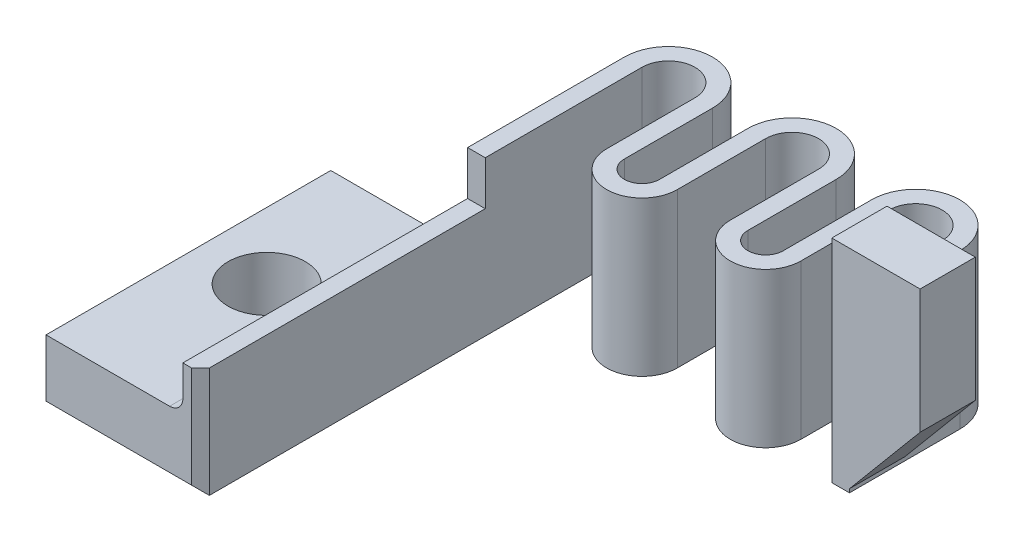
ISO-10303-21;
HEADER;
FILE_DESCRIPTION(('STEP AP214'),'2;1');
FILE_NAME('part.step','',(''),(''),'','','');
FILE_SCHEMA(('AUTOMOTIVE_DESIGN { 1 0 10303 214 1 1 1 1 }'));
ENDSEC;
DATA;
#1=APPLICATION_CONTEXT('core data for automotive mechanical design processes');
#2=APPLICATION_PROTOCOL_DEFINITION('international standard','automotive_design',2000,#1);
#3=PRODUCT_CONTEXT('',#1,'mechanical');
#4=PRODUCT('Part','Part','',(#3));
#5=PRODUCT_RELATED_PRODUCT_CATEGORY('part','',(#4));
#6=PRODUCT_DEFINITION_FORMATION('','',#4);
#7=PRODUCT_DEFINITION_CONTEXT('part definition',#1,'design');
#8=PRODUCT_DEFINITION('design','',#6,#7);
#9=PRODUCT_DEFINITION_SHAPE('','',#8);
#10=(LENGTH_UNIT() NAMED_UNIT(*) SI_UNIT(.MILLI.,.METRE.));
#11=(NAMED_UNIT(*) PLANE_ANGLE_UNIT() SI_UNIT($,.RADIAN.));
#12=(NAMED_UNIT(*) SI_UNIT($,.STERADIAN.) SOLID_ANGLE_UNIT());
#13=UNCERTAINTY_MEASURE_WITH_UNIT(LENGTH_MEASURE(1.E-05),#10,'distance_accuracy_value','');
#14=(GEOMETRIC_REPRESENTATION_CONTEXT(3) GLOBAL_UNCERTAINTY_ASSIGNED_CONTEXT((#13)) GLOBAL_UNIT_ASSIGNED_CONTEXT((#10,
#11,#12)) REPRESENTATION_CONTEXT('',''));
#15=CARTESIAN_POINT('',(0.,0.,0.));
#16=DIRECTION('',(0.,0.,1.));
#17=DIRECTION('',(1.,0.,0.));
#18=AXIS2_PLACEMENT_3D('',#15,#16,#17);
#19=CARTESIAN_POINT('',(0.,7.,0.));
#20=DIRECTION('',(1.,0.,0.));
#21=DIRECTION('',(0.,0.,-1.));
#22=AXIS2_PLACEMENT_3D('',#19,#20,#21);
#23=PLANE('',#22);
#24=DIRECTION('',(0.,-1.,0.));
#25=VECTOR('',#24,1.);
#26=CARTESIAN_POINT('',(0.,3.,-13.5));
#27=LINE('',#26,#25);
#28=CARTESIAN_POINT('',(0.,0.,-13.5));
#29=VERTEX_POINT('',#28);
#30=CARTESIAN_POINT('',(0.,3.6,-13.5));
#31=VERTEX_POINT('',#30);
#32=EDGE_CURVE('E65',#29,#31,#27,.F.);
#33=ORIENTED_EDGE('',*,*,#32,.T.);
#34=DIRECTION('',(0.,0.,-1.));
#35=VECTOR('',#34,1.);
#36=CARTESIAN_POINT('',(0.,3.6,0.));
#37=LINE('',#36,#35);
#38=CARTESIAN_POINT('',(0.,3.6,0.));
#39=VERTEX_POINT('',#38);
#40=EDGE_CURVE('E457',#31,#39,#37,.F.);
#41=ORIENTED_EDGE('',*,*,#40,.T.);
#42=DIRECTION('',(0.,-1.,0.));
#43=VECTOR('',#42,1.);
#44=CARTESIAN_POINT('',(0.,7.,0.));
#45=LINE('',#44,#43);
#46=CARTESIAN_POINT('',(0.,5.,0.));
#47=VERTEX_POINT('',#46);
#48=EDGE_CURVE('E300',#47,#39,#45,.T.);
#49=ORIENTED_EDGE('',*,*,#48,.F.);
#50=DIRECTION('',(0.,0.,1.));
#51=VECTOR('',#50,1.);
#52=CARTESIAN_POINT('',(0.,5.,0.));
#53=LINE('',#52,#51);
#54=CARTESIAN_POINT('',(0.,5.,-12.9));
#55=VERTEX_POINT('',#54);
#56=EDGE_CURVE('E289',#55,#47,#53,.T.);
#57=ORIENTED_EDGE('',*,*,#56,.F.);
#58=DIRECTION('',(0.,-1.,0.));
#59=VECTOR('',#58,1.);
#60=CARTESIAN_POINT('',(0.,7.,-12.9));
#61=LINE('',#60,#59);
#62=CARTESIAN_POINT('',(0.,7.,-12.9));
#63=VERTEX_POINT('',#62);
#64=EDGE_CURVE('E281',#63,#55,#61,.T.);
#65=ORIENTED_EDGE('',*,*,#64,.F.);
#66=DIRECTION('',(0.,0.,1.));
#67=VECTOR('',#66,1.);
#68=CARTESIAN_POINT('',(0.,7.,0.));
#69=LINE('',#68,#67);
#70=CARTESIAN_POINT('',(0.,7.,-20.));
#71=VERTEX_POINT('',#70);
#72=EDGE_CURVE('E293',#71,#63,#69,.T.);
#73=ORIENTED_EDGE('',*,*,#72,.F.);
#74=DIRECTION('',(0.,-1.,0.));
#75=VECTOR('',#74,1.);
#76=CARTESIAN_POINT('',(0.,7.,-20.));
#77=LINE('',#76,#75);
#78=CARTESIAN_POINT('',(0.,0.,-20.));
#79=VERTEX_POINT('',#78);
#80=EDGE_CURVE('E303',#71,#79,#77,.T.);
#81=ORIENTED_EDGE('',*,*,#80,.T.);
#82=DIRECTION('',(0.,0.,1.));
#83=VECTOR('',#82,1.);
#84=CARTESIAN_POINT('',(0.,0.,0.));
#85=LINE('',#84,#83);
#86=EDGE_CURVE('E356',#79,#29,#85,.T.);
#87=ORIENTED_EDGE('',*,*,#86,.T.);
#88=EDGE_LOOP('',(#33,#41,#49,#57,#65,#73,#81,#87));
#89=FACE_BOUND('',#88,.T.);
#90=ADVANCED_FACE('F41',(#89),#23,.F.);
#91=CARTESIAN_POINT('',(0.8,7.,0.));
#92=DIRECTION('',(0.,0.,-1.));
#93=DIRECTION('',(-1.,0.,0.));
#94=AXIS2_PLACEMENT_3D('',#91,#92,#93);
#95=PLANE('',#94);
#96=DIRECTION('',(0.,1.,0.));
#97=VECTOR('',#96,1.);
#98=CARTESIAN_POINT('',(0.400000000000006,7.,0.));
#99=LINE('',#98,#97);
#100=CARTESIAN_POINT('',(0.400000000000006,0.399999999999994,0.));
#101=VERTEX_POINT('',#100);
#102=CARTESIAN_POINT('',(0.400000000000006,5.,0.));
#103=VERTEX_POINT('',#102);
#104=EDGE_CURVE('E421',#101,#103,#99,.T.);
#105=ORIENTED_EDGE('',*,*,#104,.T.);
#106=DIRECTION('',(-1.,0.,0.));
#107=VECTOR('',#106,1.);
#108=CARTESIAN_POINT('',(13.8541181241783,5.,0.));
#109=LINE('',#108,#107);
#110=EDGE_CURVE('E1124',#103,#47,#109,.T.);
#111=ORIENTED_EDGE('',*,*,#110,.T.);
#112=ORIENTED_EDGE('',*,*,#48,.T.);
#113=CARTESIAN_POINT('',(-0.6,3.6,0.));
#114=DIRECTION('',(0.,0.,-1.));
#115=DIRECTION('',(-1.,0.,0.));
#116=AXIS2_PLACEMENT_3D('',#113,#114,#115);
#117=CIRCLE('',#116,0.6);
#118=CARTESIAN_POINT('',(-0.600000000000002,3.,0.));
#119=VERTEX_POINT('',#118);
#120=EDGE_CURVE('E50',#39,#119,#117,.T.);
#121=ORIENTED_EDGE('',*,*,#120,.T.);
#122=DIRECTION('',(1.,0.,0.));
#123=VECTOR('',#122,1.);
#124=CARTESIAN_POINT('',(-6.2,3.,0.));
#125=LINE('',#124,#123);
#126=CARTESIAN_POINT('',(-6.2,3.,0.));
#127=VERTEX_POINT('',#126);
#128=EDGE_CURVE('E312',#127,#119,#125,.T.);
#129=ORIENTED_EDGE('',*,*,#128,.F.);
#130=DIRECTION('',(0.,1.,0.));
#131=VECTOR('',#130,1.);
#132=CARTESIAN_POINT('',(-6.2,0.,0.));
#133=LINE('',#132,#131);
#134=CARTESIAN_POINT('',(-6.2,0.399999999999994,0.));
#135=VERTEX_POINT('',#134);
#136=EDGE_CURVE('E628',#135,#127,#133,.T.);
#137=ORIENTED_EDGE('',*,*,#136,.F.);
#138=DIRECTION('',(1.,0.,0.));
#139=VECTOR('',#138,1.);
#140=CARTESIAN_POINT('',(0.8,0.399999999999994,0.));
#141=LINE('',#140,#139);
#142=EDGE_CURVE('E424',#135,#101,#141,.T.);
#143=ORIENTED_EDGE('',*,*,#142,.T.);
#144=EDGE_LOOP('',(#105,#111,#112,#121,#129,#137,#143));
#145=FACE_BOUND('',#144,.T.);
#146=ADVANCED_FACE('F464',(#145),#95,.F.);
#147=CARTESIAN_POINT('',(0.8,7.,-20.));
#148=DIRECTION('',(-1.,0.,0.));
#149=DIRECTION('',(0.,0.,1.));
#150=AXIS2_PLACEMENT_3D('',#147,#148,#149);
#151=PLANE('',#150);
#152=DIRECTION('',(0.,1.,0.));
#153=VECTOR('',#152,1.);
#154=CARTESIAN_POINT('',(0.8,7.,-12.9));
#155=LINE('',#154,#153);
#156=CARTESIAN_POINT('',(0.8,5.,-12.9));
#157=VERTEX_POINT('',#156);
#158=CARTESIAN_POINT('',(0.8,7.,-12.9));
#159=VERTEX_POINT('',#158);
#160=EDGE_CURVE('E284',#157,#159,#155,.T.);
#161=ORIENTED_EDGE('',*,*,#160,.F.);
#162=DIRECTION('',(0.,0.,-1.));
#163=VECTOR('',#162,1.);
#164=CARTESIAN_POINT('',(0.8,5.,0.));
#165=LINE('',#164,#163);
#166=CARTESIAN_POINT('',(0.8,5.,-0.399999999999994));
#167=VERTEX_POINT('',#166);
#168=EDGE_CURVE('E1121',#167,#157,#165,.T.);
#169=ORIENTED_EDGE('',*,*,#168,.F.);
#170=DIRECTION('',(0.,-1.,0.));
#171=VECTOR('',#170,1.);
#172=CARTESIAN_POINT('',(0.8,7.,-0.399999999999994));
#173=LINE('',#172,#171);
#174=CARTESIAN_POINT('',(0.8,0.,-0.399999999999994));
#175=VERTEX_POINT('',#174);
#176=EDGE_CURVE('E431',#167,#175,#173,.T.);
#177=ORIENTED_EDGE('',*,*,#176,.T.);
#178=DIRECTION('',(0.,0.,-1.));
#179=VECTOR('',#178,1.);
#180=CARTESIAN_POINT('',(0.8,0.,-20.));
#181=LINE('',#180,#179);
#182=CARTESIAN_POINT('',(0.8,0.,-20.));
#183=VERTEX_POINT('',#182);
#184=EDGE_CURVE('E309',#175,#183,#181,.T.);
#185=ORIENTED_EDGE('',*,*,#184,.T.);
#186=DIRECTION('',(0.,-1.,0.));
#187=VECTOR('',#186,1.);
#188=CARTESIAN_POINT('',(0.8,7.,-20.));
#189=LINE('',#188,#187);
#190=CARTESIAN_POINT('',(0.8,7.,-20.));
#191=VERTEX_POINT('',#190);
#192=EDGE_CURVE('E418',#191,#183,#189,.T.);
#193=ORIENTED_EDGE('',*,*,#192,.F.);
#194=DIRECTION('',(0.,0.,-1.));
#195=VECTOR('',#194,1.);
#196=CARTESIAN_POINT('',(0.8,7.,-20.));
#197=LINE('',#196,#195);
#198=EDGE_CURVE('E357',#159,#191,#197,.T.);
#199=ORIENTED_EDGE('',*,*,#198,.F.);
#200=EDGE_LOOP('',(#161,#169,#177,#185,#193,#199));
#201=FACE_BOUND('',#200,.T.);
#202=ADVANCED_FACE('F614',(#201),#151,.F.);
#203=CARTESIAN_POINT('',(2.,7.,-20.));
#204=DIRECTION('',(0.,-1.,0.));
#205=DIRECTION('',(0.,0.,-1.));
#206=AXIS2_PLACEMENT_3D('',#203,#204,#205);
#207=CYLINDRICAL_SURFACE('',#206,1.2);
#208=CARTESIAN_POINT('',(2.,0.,-20.));
#209=DIRECTION('',(0.,-1.,0.));
#210=DIRECTION('',(0.,0.,-1.));
#211=AXIS2_PLACEMENT_3D('',#208,#209,#210);
#212=CIRCLE('',#211,1.2);
#213=CARTESIAN_POINT('',(3.2,0.,-20.));
#214=VERTEX_POINT('',#213);
#215=EDGE_CURVE('E311',#183,#214,#212,.T.);
#216=ORIENTED_EDGE('',*,*,#215,.T.);
#217=DIRECTION('',(0.,-1.,0.));
#218=VECTOR('',#217,1.);
#219=CARTESIAN_POINT('',(3.2,7.,-20.));
#220=LINE('',#219,#218);
#221=CARTESIAN_POINT('',(3.2,7.,-20.));
#222=VERTEX_POINT('',#221);
#223=EDGE_CURVE('E415',#222,#214,#220,.T.);
#224=ORIENTED_EDGE('',*,*,#223,.F.);
#225=CARTESIAN_POINT('',(2.,7.,-20.));
#226=DIRECTION('',(0.,-1.,0.));
#227=DIRECTION('',(0.,0.,-1.));
#228=AXIS2_PLACEMENT_3D('',#225,#226,#227);
#229=CIRCLE('',#228,1.2);
#230=EDGE_CURVE('E611',#191,#222,#229,.T.);
#231=ORIENTED_EDGE('',*,*,#230,.F.);
#232=ORIENTED_EDGE('',*,*,#192,.T.);
#233=EDGE_LOOP('',(#216,#224,#231,#232));
#234=FACE_BOUND('',#233,.T.);
#235=ADVANCED_FACE('F610',(#234),#207,.F.);
#236=CARTESIAN_POINT('',(3.2,7.,-20.));
#237=DIRECTION('',(1.,0.,0.));
#238=DIRECTION('',(0.,0.,-1.));
#239=AXIS2_PLACEMENT_3D('',#236,#237,#238);
#240=PLANE('',#239);
#241=DIRECTION('',(0.,0.,1.));
#242=VECTOR('',#241,1.);
#243=CARTESIAN_POINT('',(3.2,0.,-20.));
#244=LINE('',#243,#242);
#245=CARTESIAN_POINT('',(3.2,0.,-16.));
#246=VERTEX_POINT('',#245);
#247=EDGE_CURVE('E314',#214,#246,#244,.T.);
#248=ORIENTED_EDGE('',*,*,#247,.T.);
#249=DIRECTION('',(0.,-1.,0.));
#250=VECTOR('',#249,1.);
#251=CARTESIAN_POINT('',(3.2,7.,-16.));
#252=LINE('',#251,#250);
#253=CARTESIAN_POINT('',(3.2,7.,-16.));
#254=VERTEX_POINT('',#253);
#255=EDGE_CURVE('E412',#254,#246,#252,.T.);
#256=ORIENTED_EDGE('',*,*,#255,.F.);
#257=DIRECTION('',(0.,0.,1.));
#258=VECTOR('',#257,1.);
#259=CARTESIAN_POINT('',(3.2,7.,-20.));
#260=LINE('',#259,#258);
#261=EDGE_CURVE('E607',#222,#254,#260,.T.);
#262=ORIENTED_EDGE('',*,*,#261,.F.);
#263=ORIENTED_EDGE('',*,*,#223,.T.);
#264=EDGE_LOOP('',(#248,#256,#262,#263));
#265=FACE_BOUND('',#264,.T.);
#266=ADVANCED_FACE('F604',(#265),#240,.F.);
#267=CARTESIAN_POINT('',(4.8,7.,-16.));
#268=DIRECTION('',(0.,-1.,0.));
#269=DIRECTION('',(0.,0.,-1.));
#270=AXIS2_PLACEMENT_3D('',#267,#268,#269);
#271=CYLINDRICAL_SURFACE('',#270,1.6);
#272=CARTESIAN_POINT('',(4.8,0.,-16.));
#273=DIRECTION('',(0.,1.,0.));
#274=DIRECTION('',(0.,0.,1.));
#275=AXIS2_PLACEMENT_3D('',#272,#273,#274);
#276=CIRCLE('',#275,1.6);
#277=CARTESIAN_POINT('',(6.4,0.,-16.));
#278=VERTEX_POINT('',#277);
#279=EDGE_CURVE('E316',#246,#278,#276,.T.);
#280=ORIENTED_EDGE('',*,*,#279,.T.);
#281=DIRECTION('',(0.,-1.,0.));
#282=VECTOR('',#281,1.);
#283=CARTESIAN_POINT('',(6.4,7.,-16.));
#284=LINE('',#283,#282);
#285=CARTESIAN_POINT('',(6.4,7.,-16.));
#286=VERTEX_POINT('',#285);
#287=EDGE_CURVE('E409',#286,#278,#284,.T.);
#288=ORIENTED_EDGE('',*,*,#287,.F.);
#289=CARTESIAN_POINT('',(4.8,7.,-16.));
#290=DIRECTION('',(0.,1.,0.));
#291=DIRECTION('',(0.,0.,1.));
#292=AXIS2_PLACEMENT_3D('',#289,#290,#291);
#293=CIRCLE('',#292,1.6);
#294=EDGE_CURVE('E599',#254,#286,#293,.T.);
#295=ORIENTED_EDGE('',*,*,#294,.F.);
#296=ORIENTED_EDGE('',*,*,#255,.T.);
#297=EDGE_LOOP('',(#280,#288,#295,#296));
#298=FACE_BOUND('',#297,.T.);
#299=ADVANCED_FACE('F598',(#298),#271,.T.);
#300=CARTESIAN_POINT('',(6.4,7.,-16.));
#301=DIRECTION('',(-1.,0.,0.));
#302=DIRECTION('',(0.,0.,1.));
#303=AXIS2_PLACEMENT_3D('',#300,#301,#302);
#304=PLANE('',#303);
#305=DIRECTION('',(0.,0.,-1.));
#306=VECTOR('',#305,1.);
#307=CARTESIAN_POINT('',(6.4,0.,-16.));
#308=LINE('',#307,#306);
#309=CARTESIAN_POINT('',(6.4,0.,-20.));
#310=VERTEX_POINT('',#309);
#311=EDGE_CURVE('E318',#278,#310,#308,.T.);
#312=ORIENTED_EDGE('',*,*,#311,.T.);
#313=DIRECTION('',(0.,-1.,0.));
#314=VECTOR('',#313,1.);
#315=CARTESIAN_POINT('',(6.4,7.,-20.));
#316=LINE('',#315,#314);
#317=CARTESIAN_POINT('',(6.4,7.,-20.));
#318=VERTEX_POINT('',#317);
#319=EDGE_CURVE('E406',#318,#310,#316,.T.);
#320=ORIENTED_EDGE('',*,*,#319,.F.);
#321=DIRECTION('',(0.,0.,-1.));
#322=VECTOR('',#321,1.);
#323=CARTESIAN_POINT('',(6.4,7.,-16.));
#324=LINE('',#323,#322);
#325=EDGE_CURVE('E594',#286,#318,#324,.T.);
#326=ORIENTED_EDGE('',*,*,#325,.F.);
#327=ORIENTED_EDGE('',*,*,#287,.T.);
#328=EDGE_LOOP('',(#312,#320,#326,#327));
#329=FACE_BOUND('',#328,.T.);
#330=ADVANCED_FACE('F593',(#329),#304,.F.);
#331=CARTESIAN_POINT('',(7.6,7.,-20.));
#332=DIRECTION('',(0.,-1.,0.));
#333=DIRECTION('',(0.,0.,-1.));
#334=AXIS2_PLACEMENT_3D('',#331,#332,#333);
#335=CYLINDRICAL_SURFACE('',#334,1.2);
#336=CARTESIAN_POINT('',(7.6,0.,-20.));
#337=DIRECTION('',(0.,-1.,0.));
#338=DIRECTION('',(0.,0.,-1.));
#339=AXIS2_PLACEMENT_3D('',#336,#337,#338);
#340=CIRCLE('',#339,1.2);
#341=CARTESIAN_POINT('',(8.8,0.,-20.));
#342=VERTEX_POINT('',#341);
#343=EDGE_CURVE('E320',#310,#342,#340,.T.);
#344=ORIENTED_EDGE('',*,*,#343,.T.);
#345=DIRECTION('',(0.,-1.,0.));
#346=VECTOR('',#345,1.);
#347=CARTESIAN_POINT('',(8.8,7.,-20.));
#348=LINE('',#347,#346);
#349=CARTESIAN_POINT('',(8.8,7.,-20.));
#350=VERTEX_POINT('',#349);
#351=EDGE_CURVE('E403',#350,#342,#348,.T.);
#352=ORIENTED_EDGE('',*,*,#351,.F.);
#353=CARTESIAN_POINT('',(7.6,7.,-20.));
#354=DIRECTION('',(0.,-1.,0.));
#355=DIRECTION('',(0.,0.,-1.));
#356=AXIS2_PLACEMENT_3D('',#353,#354,#355);
#357=CIRCLE('',#356,1.2);
#358=EDGE_CURVE('E590',#318,#350,#357,.T.);
#359=ORIENTED_EDGE('',*,*,#358,.F.);
#360=ORIENTED_EDGE('',*,*,#319,.T.);
#361=EDGE_LOOP('',(#344,#352,#359,#360));
#362=FACE_BOUND('',#361,.T.);
#363=ADVANCED_FACE('F587',(#362),#335,.F.);
#364=CARTESIAN_POINT('',(8.8,7.,-20.));
#365=DIRECTION('',(1.,0.,0.));
#366=DIRECTION('',(0.,0.,-1.));
#367=AXIS2_PLACEMENT_3D('',#364,#365,#366);
#368=PLANE('',#367);
#369=DIRECTION('',(0.,0.,1.));
#370=VECTOR('',#369,1.);
#371=CARTESIAN_POINT('',(8.8,0.,-20.));
#372=LINE('',#371,#370);
#373=CARTESIAN_POINT('',(8.8,0.,-16.));
#374=VERTEX_POINT('',#373);
#375=EDGE_CURVE('E322',#342,#374,#372,.T.);
#376=ORIENTED_EDGE('',*,*,#375,.T.);
#377=DIRECTION('',(0.,-1.,0.));
#378=VECTOR('',#377,1.);
#379=CARTESIAN_POINT('',(8.8,7.,-16.));
#380=LINE('',#379,#378);
#381=CARTESIAN_POINT('',(8.8,7.,-16.));
#382=VERTEX_POINT('',#381);
#383=EDGE_CURVE('E400',#382,#374,#380,.T.);
#384=ORIENTED_EDGE('',*,*,#383,.F.);
#385=DIRECTION('',(0.,0.,1.));
#386=VECTOR('',#385,1.);
#387=CARTESIAN_POINT('',(8.8,7.,-20.));
#388=LINE('',#387,#386);
#389=EDGE_CURVE('E581',#350,#382,#388,.T.);
#390=ORIENTED_EDGE('',*,*,#389,.F.);
#391=ORIENTED_EDGE('',*,*,#351,.T.);
#392=EDGE_LOOP('',(#376,#384,#390,#391));
#393=FACE_BOUND('',#392,.T.);
#394=ADVANCED_FACE('F580',(#393),#368,.F.);
#395=CARTESIAN_POINT('',(10.4,7.,-16.));
#396=DIRECTION('',(0.,-1.,0.));
#397=DIRECTION('',(0.,0.,-1.));
#398=AXIS2_PLACEMENT_3D('',#395,#396,#397);
#399=CYLINDRICAL_SURFACE('',#398,1.6);
#400=CARTESIAN_POINT('',(10.4,0.,-16.));
#401=DIRECTION('',(0.,1.,0.));
#402=DIRECTION('',(0.,0.,1.));
#403=AXIS2_PLACEMENT_3D('',#400,#401,#402);
#404=CIRCLE('',#403,1.6);
#405=CARTESIAN_POINT('',(12.,0.,-16.));
#406=VERTEX_POINT('',#405);
#407=EDGE_CURVE('E324',#374,#406,#404,.T.);
#408=ORIENTED_EDGE('',*,*,#407,.T.);
#409=DIRECTION('',(0.,-1.,0.));
#410=VECTOR('',#409,1.);
#411=CARTESIAN_POINT('',(12.,7.,-16.));
#412=LINE('',#411,#410);
#413=CARTESIAN_POINT('',(12.,7.,-16.));
#414=VERTEX_POINT('',#413);
#415=EDGE_CURVE('E397',#414,#406,#412,.T.);
#416=ORIENTED_EDGE('',*,*,#415,.F.);
#417=CARTESIAN_POINT('',(10.4,7.,-16.));
#418=DIRECTION('',(0.,1.,0.));
#419=DIRECTION('',(0.,0.,1.));
#420=AXIS2_PLACEMENT_3D('',#417,#418,#419);
#421=CIRCLE('',#420,1.6);
#422=EDGE_CURVE('E576',#382,#414,#421,.T.);
#423=ORIENTED_EDGE('',*,*,#422,.F.);
#424=ORIENTED_EDGE('',*,*,#383,.T.);
#425=EDGE_LOOP('',(#408,#416,#423,#424));
#426=FACE_BOUND('',#425,.T.);
#427=ADVANCED_FACE('F575',(#426),#399,.T.);
#428=CARTESIAN_POINT('',(12.,7.,-20.));
#429=DIRECTION('',(-1.,0.,0.));
#430=DIRECTION('',(0.,0.,1.));
#431=AXIS2_PLACEMENT_3D('',#428,#429,#430);
#432=PLANE('',#431);
#433=DIRECTION('',(0.,0.,-1.));
#434=VECTOR('',#433,1.);
#435=CARTESIAN_POINT('',(12.,0.,-20.));
#436=LINE('',#435,#434);
#437=CARTESIAN_POINT('',(12.,0.,-20.));
#438=VERTEX_POINT('',#437);
#439=EDGE_CURVE('E326',#406,#438,#436,.T.);
#440=ORIENTED_EDGE('',*,*,#439,.T.);
#441=DIRECTION('',(0.,-1.,0.));
#442=VECTOR('',#441,1.);
#443=CARTESIAN_POINT('',(12.,7.,-20.));
#444=LINE('',#443,#442);
#445=CARTESIAN_POINT('',(12.,7.,-20.));
#446=VERTEX_POINT('',#445);
#447=EDGE_CURVE('E394',#446,#438,#444,.T.);
#448=ORIENTED_EDGE('',*,*,#447,.F.);
#449=DIRECTION('',(0.,0.,-1.));
#450=VECTOR('',#449,1.);
#451=CARTESIAN_POINT('',(12.,7.,-20.));
#452=LINE('',#451,#450);
#453=EDGE_CURVE('E572',#414,#446,#452,.T.);
#454=ORIENTED_EDGE('',*,*,#453,.F.);
#455=ORIENTED_EDGE('',*,*,#415,.T.);
#456=EDGE_LOOP('',(#440,#448,#454,#455));
#457=FACE_BOUND('',#456,.T.);
#458=ADVANCED_FACE('F569',(#457),#432,.F.);
#459=CARTESIAN_POINT('',(13.2,7.,-20.));
#460=DIRECTION('',(0.,-1.,0.));
#461=DIRECTION('',(0.,0.,-1.));
#462=AXIS2_PLACEMENT_3D('',#459,#460,#461);
#463=CYLINDRICAL_SURFACE('',#462,1.2);
#464=CARTESIAN_POINT('',(13.2,0.,-20.));
#465=DIRECTION('',(0.,-1.,0.));
#466=DIRECTION('',(0.,0.,-1.));
#467=AXIS2_PLACEMENT_3D('',#464,#465,#466);
#468=CIRCLE('',#467,1.2);
#469=CARTESIAN_POINT('',(14.4,0.,-20.));
#470=VERTEX_POINT('',#469);
#471=EDGE_CURVE('E328',#438,#470,#468,.T.);
#472=ORIENTED_EDGE('',*,*,#471,.T.);
#473=DIRECTION('',(0.,-1.,0.));
#474=VECTOR('',#473,1.);
#475=CARTESIAN_POINT('',(14.4,7.,-20.));
#476=LINE('',#475,#474);
#477=CARTESIAN_POINT('',(14.4,7.,-20.));
#478=VERTEX_POINT('',#477);
#479=EDGE_CURVE('E391',#478,#470,#476,.T.);
#480=ORIENTED_EDGE('',*,*,#479,.F.);
#481=CARTESIAN_POINT('',(13.2,7.,-20.));
#482=DIRECTION('',(0.,-1.,0.));
#483=DIRECTION('',(0.,0.,-1.));
#484=AXIS2_PLACEMENT_3D('',#481,#482,#483);
#485=CIRCLE('',#484,1.2);
#486=EDGE_CURVE('E563',#446,#478,#485,.T.);
#487=ORIENTED_EDGE('',*,*,#486,.F.);
#488=ORIENTED_EDGE('',*,*,#447,.T.);
#489=EDGE_LOOP('',(#472,#480,#487,#488));
#490=FACE_BOUND('',#489,.T.);
#491=ADVANCED_FACE('F562',(#490),#463,.F.);
#492=CARTESIAN_POINT('',(14.4,7.,-15.));
#493=DIRECTION('',(1.,0.,0.));
#494=DIRECTION('',(0.,0.,-1.));
#495=AXIS2_PLACEMENT_3D('',#492,#493,#494);
#496=PLANE('',#495);
#497=DIRECTION('',(0.,1.,0.));
#498=VECTOR('',#497,1.);
#499=CARTESIAN_POINT('',(14.4,6.6,-17.5));
#500=LINE('',#499,#498);
#501=CARTESIAN_POINT('',(14.4,7.,-17.5));
#502=VERTEX_POINT('',#501);
#503=CARTESIAN_POINT('',(14.4,9.6,-17.5));
#504=VERTEX_POINT('',#503);
#505=EDGE_CURVE('E665',#502,#504,#500,.T.);
#506=ORIENTED_EDGE('',*,*,#505,.F.);
#507=DIRECTION('',(0.,0.,1.));
#508=VECTOR('',#507,1.);
#509=CARTESIAN_POINT('',(14.4,7.,-15.));
#510=LINE('',#509,#508);
#511=EDGE_CURVE('E559',#478,#502,#510,.T.);
#512=ORIENTED_EDGE('',*,*,#511,.F.);
#513=ORIENTED_EDGE('',*,*,#479,.T.);
#514=DIRECTION('',(0.,0.,1.));
#515=VECTOR('',#514,1.);
#516=CARTESIAN_POINT('',(14.4,0.,-15.));
#517=LINE('',#516,#515);
#518=CARTESIAN_POINT('',(14.4,0.,-15.));
#519=VERTEX_POINT('',#518);
#520=EDGE_CURVE('E330',#470,#519,#517,.T.);
#521=ORIENTED_EDGE('',*,*,#520,.T.);
#522=DIRECTION('',(0.,-1.,0.));
#523=VECTOR('',#522,1.);
#524=CARTESIAN_POINT('',(14.4,7.,-15.));
#525=LINE('',#524,#523);
#526=CARTESIAN_POINT('',(14.4,9.6,-15.));
#527=VERTEX_POINT('',#526);
#528=EDGE_CURVE('E389',#527,#519,#525,.T.);
#529=ORIENTED_EDGE('',*,*,#528,.F.);
#530=DIRECTION('',(0.,0.,1.));
#531=VECTOR('',#530,1.);
#532=CARTESIAN_POINT('',(14.4,9.6,-15.));
#533=LINE('',#532,#531);
#534=EDGE_CURVE('E667',#504,#527,#533,.T.);
#535=ORIENTED_EDGE('',*,*,#534,.F.);
#536=EDGE_LOOP('',(#506,#512,#513,#521,#529,#535));
#537=FACE_BOUND('',#536,.T.);
#538=ADVANCED_FACE('F556',(#537),#496,.F.);
#539=CARTESIAN_POINT('',(14.4,7.,-15.));
#540=DIRECTION('',(0.,0.,-1.));
#541=DIRECTION('',(-1.,0.,0.));
#542=AXIS2_PLACEMENT_3D('',#539,#540,#541);
#543=PLANE('',#542);
#544=DIRECTION('',(0.,-1.,0.));
#545=VECTOR('',#544,1.);
#546=CARTESIAN_POINT('',(15.2,7.,-15.));
#547=LINE('',#546,#545);
#548=CARTESIAN_POINT('',(15.2,0.164530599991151,-15.));
#549=VERTEX_POINT('',#548);
#550=CARTESIAN_POINT('',(15.2,0.,-15.));
#551=VERTEX_POINT('',#550);
#552=EDGE_CURVE('E387',#549,#551,#547,.T.);
#553=ORIENTED_EDGE('',*,*,#552,.F.);
#554=DIRECTION('',(0.642787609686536,0.766044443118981,0.));
#555=VECTOR('',#554,1.);
#556=CARTESIAN_POINT('',(18.23527090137,3.78182560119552,-15.));
#557=LINE('',#556,#555);
#558=CARTESIAN_POINT('',(18.4,3.97814209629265,-15.));
#559=VERTEX_POINT('',#558);
#560=EDGE_CURVE('E442',#549,#559,#557,.T.);
#561=ORIENTED_EDGE('',*,*,#560,.T.);
#562=DIRECTION('',(0.,1.,0.));
#563=VECTOR('',#562,1.);
#564=CARTESIAN_POINT('',(18.4,6.6,-15.));
#565=LINE('',#564,#563);
#566=CARTESIAN_POINT('',(18.4,9.6,-15.));
#567=VERTEX_POINT('',#566);
#568=EDGE_CURVE('E671',#559,#567,#565,.T.);
#569=ORIENTED_EDGE('',*,*,#568,.T.);
#570=DIRECTION('',(1.,0.,0.));
#571=VECTOR('',#570,1.);
#572=CARTESIAN_POINT('',(14.4,9.6,-15.));
#573=LINE('',#572,#571);
#574=EDGE_CURVE('E551',#527,#567,#573,.T.);
#575=ORIENTED_EDGE('',*,*,#574,.F.);
#576=ORIENTED_EDGE('',*,*,#528,.T.);
#577=DIRECTION('',(1.,0.,0.));
#578=VECTOR('',#577,1.);
#579=CARTESIAN_POINT('',(14.4,0.,-15.));
#580=LINE('',#579,#578);
#581=EDGE_CURVE('E333',#519,#551,#580,.T.);
#582=ORIENTED_EDGE('',*,*,#581,.T.);
#583=EDGE_LOOP('',(#553,#561,#569,#575,#576,#582));
#584=FACE_BOUND('',#583,.T.);
#585=ADVANCED_FACE('F548',(#584),#543,.F.);
#586=CARTESIAN_POINT('',(15.2,7.,-15.));
#587=DIRECTION('',(-1.,0.,0.));
#588=DIRECTION('',(0.,0.,1.));
#589=AXIS2_PLACEMENT_3D('',#586,#587,#588);
#590=PLANE('',#589);
#591=DIRECTION('',(0.,-1.,0.));
#592=VECTOR('',#591,1.);
#593=CARTESIAN_POINT('',(15.2,7.,-17.5));
#594=LINE('',#593,#592);
#595=CARTESIAN_POINT('',(15.2,7.,-17.5));
#596=VERTEX_POINT('',#595);
#597=CARTESIAN_POINT('',(15.2,0.164530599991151,-17.5));
#598=VERTEX_POINT('',#597);
#599=EDGE_CURVE('E437',#596,#598,#594,.T.);
#600=ORIENTED_EDGE('',*,*,#599,.T.);
#601=DIRECTION('',(0.,0.,1.));
#602=VECTOR('',#601,1.);
#603=CARTESIAN_POINT('',(15.2,0.164530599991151,-15.));
#604=LINE('',#603,#602);
#605=EDGE_CURVE('E439',#598,#549,#604,.T.);
#606=ORIENTED_EDGE('',*,*,#605,.T.);
#607=ORIENTED_EDGE('',*,*,#552,.T.);
#608=DIRECTION('',(0.,0.,-1.));
#609=VECTOR('',#608,1.);
#610=CARTESIAN_POINT('',(15.2,0.,-15.));
#611=LINE('',#610,#609);
#612=CARTESIAN_POINT('',(15.2,0.,-20.));
#613=VERTEX_POINT('',#612);
#614=EDGE_CURVE('E336',#551,#613,#611,.T.);
#615=ORIENTED_EDGE('',*,*,#614,.T.);
#616=DIRECTION('',(0.,-1.,0.));
#617=VECTOR('',#616,1.);
#618=CARTESIAN_POINT('',(15.2,7.,-20.));
#619=LINE('',#618,#617);
#620=CARTESIAN_POINT('',(15.2,7.,-20.));
#621=VERTEX_POINT('',#620);
#622=EDGE_CURVE('E384',#621,#613,#619,.T.);
#623=ORIENTED_EDGE('',*,*,#622,.F.);
#624=DIRECTION('',(0.,0.,-1.));
#625=VECTOR('',#624,1.);
#626=CARTESIAN_POINT('',(15.2,7.,-15.));
#627=LINE('',#626,#625);
#628=EDGE_CURVE('E541',#596,#621,#627,.T.);
#629=ORIENTED_EDGE('',*,*,#628,.F.);
#630=EDGE_LOOP('',(#600,#606,#607,#615,#623,#629));
#631=FACE_BOUND('',#630,.T.);
#632=ADVANCED_FACE('F540',(#631),#590,.F.);
#633=CARTESIAN_POINT('',(13.2,7.,-20.));
#634=DIRECTION('',(0.,-1.,0.));
#635=DIRECTION('',(0.,0.,-1.));
#636=AXIS2_PLACEMENT_3D('',#633,#634,#635);
#637=CYLINDRICAL_SURFACE('',#636,2.);
#638=CARTESIAN_POINT('',(13.2,0.,-20.));
#639=DIRECTION('',(0.,1.,0.));
#640=DIRECTION('',(0.,0.,-1.));
#641=AXIS2_PLACEMENT_3D('',#638,#639,#640);
#642=CIRCLE('',#641,2.);
#643=CARTESIAN_POINT('',(11.2,0.,-20.));
#644=VERTEX_POINT('',#643);
#645=EDGE_CURVE('E338',#613,#644,#642,.T.);
#646=ORIENTED_EDGE('',*,*,#645,.T.);
#647=DIRECTION('',(0.,-1.,0.));
#648=VECTOR('',#647,1.);
#649=CARTESIAN_POINT('',(11.2,7.,-20.));
#650=LINE('',#649,#648);
#651=CARTESIAN_POINT('',(11.2,7.,-20.));
#652=VERTEX_POINT('',#651);
#653=EDGE_CURVE('E381',#652,#644,#650,.T.);
#654=ORIENTED_EDGE('',*,*,#653,.F.);
#655=CARTESIAN_POINT('',(13.2,7.,-20.));
#656=DIRECTION('',(0.,1.,0.));
#657=DIRECTION('',(0.,0.,-1.));
#658=AXIS2_PLACEMENT_3D('',#655,#656,#657);
#659=CIRCLE('',#658,2.);
#660=EDGE_CURVE('E536',#621,#652,#659,.T.);
#661=ORIENTED_EDGE('',*,*,#660,.F.);
#662=ORIENTED_EDGE('',*,*,#622,.T.);
#663=EDGE_LOOP('',(#646,#654,#661,#662));
#664=FACE_BOUND('',#663,.T.);
#665=ADVANCED_FACE('F535',(#664),#637,.T.);
#666=CARTESIAN_POINT('',(11.2,7.,-20.));
#667=DIRECTION('',(1.,0.,0.));
#668=DIRECTION('',(0.,0.,-1.));
#669=AXIS2_PLACEMENT_3D('',#666,#667,#668);
#670=PLANE('',#669);
#671=DIRECTION('',(0.,0.,1.));
#672=VECTOR('',#671,1.);
#673=CARTESIAN_POINT('',(11.2,0.,-20.));
#674=LINE('',#673,#672);
#675=CARTESIAN_POINT('',(11.2,0.,-16.));
#676=VERTEX_POINT('',#675);
#677=EDGE_CURVE('E340',#644,#676,#674,.T.);
#678=ORIENTED_EDGE('',*,*,#677,.T.);
#679=DIRECTION('',(0.,-1.,0.));
#680=VECTOR('',#679,1.);
#681=CARTESIAN_POINT('',(11.2,7.,-16.));
#682=LINE('',#681,#680);
#683=CARTESIAN_POINT('',(11.2,7.,-16.));
#684=VERTEX_POINT('',#683);
#685=EDGE_CURVE('E378',#684,#676,#682,.T.);
#686=ORIENTED_EDGE('',*,*,#685,.F.);
#687=DIRECTION('',(0.,0.,1.));
#688=VECTOR('',#687,1.);
#689=CARTESIAN_POINT('',(11.2,7.,-20.));
#690=LINE('',#689,#688);
#691=EDGE_CURVE('E532',#652,#684,#690,.T.);
#692=ORIENTED_EDGE('',*,*,#691,.F.);
#693=ORIENTED_EDGE('',*,*,#653,.T.);
#694=EDGE_LOOP('',(#678,#686,#692,#693));
#695=FACE_BOUND('',#694,.T.);
#696=ADVANCED_FACE('F529',(#695),#670,.F.);
#697=CARTESIAN_POINT('',(10.4,7.,-16.));
#698=DIRECTION('',(0.,-1.,0.));
#699=DIRECTION('',(0.,0.,-1.));
#700=AXIS2_PLACEMENT_3D('',#697,#698,#699);
#701=CYLINDRICAL_SURFACE('',#700,0.8);
#702=CARTESIAN_POINT('',(10.4,0.,-16.));
#703=DIRECTION('',(0.,-1.,0.));
#704=DIRECTION('',(0.,0.,1.));
#705=AXIS2_PLACEMENT_3D('',#702,#703,#704);
#706=CIRCLE('',#705,0.8);
#707=CARTESIAN_POINT('',(9.6,0.,-16.));
#708=VERTEX_POINT('',#707);
#709=EDGE_CURVE('E342',#676,#708,#706,.T.);
#710=ORIENTED_EDGE('',*,*,#709,.T.);
#711=DIRECTION('',(0.,-1.,0.));
#712=VECTOR('',#711,1.);
#713=CARTESIAN_POINT('',(9.6,7.,-16.));
#714=LINE('',#713,#712);
#715=CARTESIAN_POINT('',(9.6,7.,-16.));
#716=VERTEX_POINT('',#715);
#717=EDGE_CURVE('E375',#716,#708,#714,.T.);
#718=ORIENTED_EDGE('',*,*,#717,.F.);
#719=CARTESIAN_POINT('',(10.4,7.,-16.));
#720=DIRECTION('',(0.,-1.,0.));
#721=DIRECTION('',(0.,0.,1.));
#722=AXIS2_PLACEMENT_3D('',#719,#720,#721);
#723=CIRCLE('',#722,0.8);
#724=EDGE_CURVE('E523',#684,#716,#723,.T.);
#725=ORIENTED_EDGE('',*,*,#724,.F.);
#726=ORIENTED_EDGE('',*,*,#685,.T.);
#727=EDGE_LOOP('',(#710,#718,#725,#726));
#728=FACE_BOUND('',#727,.T.);
#729=ADVANCED_FACE('F522',(#728),#701,.F.);
#730=CARTESIAN_POINT('',(9.6,7.,-20.));
#731=DIRECTION('',(-1.,0.,0.));
#732=DIRECTION('',(0.,0.,1.));
#733=AXIS2_PLACEMENT_3D('',#730,#731,#732);
#734=PLANE('',#733);
#735=DIRECTION('',(0.,0.,-1.));
#736=VECTOR('',#735,1.);
#737=CARTESIAN_POINT('',(9.6,0.,-20.));
#738=LINE('',#737,#736);
#739=CARTESIAN_POINT('',(9.6,0.,-20.));
#740=VERTEX_POINT('',#739);
#741=EDGE_CURVE('E344',#708,#740,#738,.T.);
#742=ORIENTED_EDGE('',*,*,#741,.T.);
#743=DIRECTION('',(0.,-1.,0.));
#744=VECTOR('',#743,1.);
#745=CARTESIAN_POINT('',(9.6,7.,-20.));
#746=LINE('',#745,#744);
#747=CARTESIAN_POINT('',(9.6,7.,-20.));
#748=VERTEX_POINT('',#747);
#749=EDGE_CURVE('E372',#748,#740,#746,.T.);
#750=ORIENTED_EDGE('',*,*,#749,.F.);
#751=DIRECTION('',(0.,0.,-1.));
#752=VECTOR('',#751,1.);
#753=CARTESIAN_POINT('',(9.6,7.,-20.));
#754=LINE('',#753,#752);
#755=EDGE_CURVE('E518',#716,#748,#754,.T.);
#756=ORIENTED_EDGE('',*,*,#755,.F.);
#757=ORIENTED_EDGE('',*,*,#717,.T.);
#758=EDGE_LOOP('',(#742,#750,#756,#757));
#759=FACE_BOUND('',#758,.T.);
#760=ADVANCED_FACE('F517',(#759),#734,.F.);
#761=CARTESIAN_POINT('',(7.6,7.,-20.));
#762=DIRECTION('',(0.,-1.,0.));
#763=DIRECTION('',(0.,0.,-1.));
#764=AXIS2_PLACEMENT_3D('',#761,#762,#763);
#765=CYLINDRICAL_SURFACE('',#764,2.);
#766=CARTESIAN_POINT('',(7.6,0.,-20.));
#767=DIRECTION('',(0.,1.,0.));
#768=DIRECTION('',(0.,0.,-1.));
#769=AXIS2_PLACEMENT_3D('',#766,#767,#768);
#770=CIRCLE('',#769,2.);
#771=CARTESIAN_POINT('',(5.6,0.,-20.));
#772=VERTEX_POINT('',#771);
#773=EDGE_CURVE('E346',#740,#772,#770,.T.);
#774=ORIENTED_EDGE('',*,*,#773,.T.);
#775=DIRECTION('',(0.,-1.,0.));
#776=VECTOR('',#775,1.);
#777=CARTESIAN_POINT('',(5.6,7.,-20.));
#778=LINE('',#777,#776);
#779=CARTESIAN_POINT('',(5.6,7.,-20.));
#780=VERTEX_POINT('',#779);
#781=EDGE_CURVE('E369',#780,#772,#778,.T.);
#782=ORIENTED_EDGE('',*,*,#781,.F.);
#783=CARTESIAN_POINT('',(7.6,7.,-20.));
#784=DIRECTION('',(0.,1.,0.));
#785=DIRECTION('',(0.,0.,-1.));
#786=AXIS2_PLACEMENT_3D('',#783,#784,#785);
#787=CIRCLE('',#786,2.);
#788=EDGE_CURVE('E514',#748,#780,#787,.T.);
#789=ORIENTED_EDGE('',*,*,#788,.F.);
#790=ORIENTED_EDGE('',*,*,#749,.T.);
#791=EDGE_LOOP('',(#774,#782,#789,#790));
#792=FACE_BOUND('',#791,.T.);
#793=ADVANCED_FACE('F511',(#792),#765,.T.);
#794=CARTESIAN_POINT('',(5.6,7.,-16.));
#795=DIRECTION('',(1.,0.,0.));
#796=DIRECTION('',(0.,0.,-1.));
#797=AXIS2_PLACEMENT_3D('',#794,#795,#796);
#798=PLANE('',#797);
#799=DIRECTION('',(0.,0.,1.));
#800=VECTOR('',#799,1.);
#801=CARTESIAN_POINT('',(5.6,0.,-16.));
#802=LINE('',#801,#800);
#803=CARTESIAN_POINT('',(5.6,0.,-16.));
#804=VERTEX_POINT('',#803);
#805=EDGE_CURVE('E348',#772,#804,#802,.T.);
#806=ORIENTED_EDGE('',*,*,#805,.T.);
#807=DIRECTION('',(0.,-1.,0.));
#808=VECTOR('',#807,1.);
#809=CARTESIAN_POINT('',(5.6,7.,-16.));
#810=LINE('',#809,#808);
#811=CARTESIAN_POINT('',(5.6,7.,-16.));
#812=VERTEX_POINT('',#811);
#813=EDGE_CURVE('E366',#812,#804,#810,.T.);
#814=ORIENTED_EDGE('',*,*,#813,.F.);
#815=DIRECTION('',(0.,0.,1.));
#816=VECTOR('',#815,1.);
#817=CARTESIAN_POINT('',(5.6,7.,-16.));
#818=LINE('',#817,#816);
#819=EDGE_CURVE('E505',#780,#812,#818,.T.);
#820=ORIENTED_EDGE('',*,*,#819,.F.);
#821=ORIENTED_EDGE('',*,*,#781,.T.);
#822=EDGE_LOOP('',(#806,#814,#820,#821));
#823=FACE_BOUND('',#822,.T.);
#824=ADVANCED_FACE('F504',(#823),#798,.F.);
#825=CARTESIAN_POINT('',(4.8,7.,-16.));
#826=DIRECTION('',(0.,-1.,0.));
#827=DIRECTION('',(0.,0.,-1.));
#828=AXIS2_PLACEMENT_3D('',#825,#826,#827);
#829=CYLINDRICAL_SURFACE('',#828,0.799999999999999);
#830=CARTESIAN_POINT('',(4.8,0.,-16.));
#831=DIRECTION('',(0.,-1.,0.));
#832=DIRECTION('',(0.,0.,1.));
#833=AXIS2_PLACEMENT_3D('',#830,#831,#832);
#834=CIRCLE('',#833,0.799999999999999);
#835=CARTESIAN_POINT('',(4.,0.,-16.));
#836=VERTEX_POINT('',#835);
#837=EDGE_CURVE('E350',#804,#836,#834,.T.);
#838=ORIENTED_EDGE('',*,*,#837,.T.);
#839=DIRECTION('',(0.,-1.,0.));
#840=VECTOR('',#839,1.);
#841=CARTESIAN_POINT('',(4.,7.,-16.));
#842=LINE('',#841,#840);
#843=CARTESIAN_POINT('',(4.,7.,-16.));
#844=VERTEX_POINT('',#843);
#845=EDGE_CURVE('E363',#844,#836,#842,.T.);
#846=ORIENTED_EDGE('',*,*,#845,.F.);
#847=CARTESIAN_POINT('',(4.8,7.,-16.));
#848=DIRECTION('',(0.,-1.,0.));
#849=DIRECTION('',(0.,0.,1.));
#850=AXIS2_PLACEMENT_3D('',#847,#848,#849);
#851=CIRCLE('',#850,0.799999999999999);
#852=EDGE_CURVE('E500',#812,#844,#851,.T.);
#853=ORIENTED_EDGE('',*,*,#852,.F.);
#854=ORIENTED_EDGE('',*,*,#813,.T.);
#855=EDGE_LOOP('',(#838,#846,#853,#854));
#856=FACE_BOUND('',#855,.T.);
#857=ADVANCED_FACE('F499',(#856),#829,.F.);
#858=CARTESIAN_POINT('',(4.,7.,-20.));
#859=DIRECTION('',(-1.,0.,0.));
#860=DIRECTION('',(0.,0.,1.));
#861=AXIS2_PLACEMENT_3D('',#858,#859,#860);
#862=PLANE('',#861);
#863=DIRECTION('',(0.,0.,-1.));
#864=VECTOR('',#863,1.);
#865=CARTESIAN_POINT('',(4.,0.,-20.));
#866=LINE('',#865,#864);
#867=CARTESIAN_POINT('',(4.,0.,-20.));
#868=VERTEX_POINT('',#867);
#869=EDGE_CURVE('E352',#836,#868,#866,.T.);
#870=ORIENTED_EDGE('',*,*,#869,.T.);
#871=DIRECTION('',(0.,-1.,0.));
#872=VECTOR('',#871,1.);
#873=CARTESIAN_POINT('',(4.,7.,-20.));
#874=LINE('',#873,#872);
#875=CARTESIAN_POINT('',(4.,7.,-20.));
#876=VERTEX_POINT('',#875);
#877=EDGE_CURVE('E360',#876,#868,#874,.T.);
#878=ORIENTED_EDGE('',*,*,#877,.F.);
#879=DIRECTION('',(0.,0.,-1.));
#880=VECTOR('',#879,1.);
#881=CARTESIAN_POINT('',(4.,7.,-20.));
#882=LINE('',#881,#880);
#883=EDGE_CURVE('E305',#844,#876,#882,.T.);
#884=ORIENTED_EDGE('',*,*,#883,.F.);
#885=ORIENTED_EDGE('',*,*,#845,.T.);
#886=EDGE_LOOP('',(#870,#878,#884,#885));
#887=FACE_BOUND('',#886,.T.);
#888=ADVANCED_FACE('F494',(#887),#862,.F.);
#889=CARTESIAN_POINT('',(2.,7.,-20.));
#890=DIRECTION('',(0.,-1.,0.));
#891=DIRECTION('',(0.,0.,-1.));
#892=AXIS2_PLACEMENT_3D('',#889,#890,#891);
#893=CYLINDRICAL_SURFACE('',#892,2.);
#894=CARTESIAN_POINT('',(2.,0.,-20.));
#895=DIRECTION('',(0.,1.,0.));
#896=DIRECTION('',(0.,0.,-1.));
#897=AXIS2_PLACEMENT_3D('',#894,#895,#896);
#898=CIRCLE('',#897,2.);
#899=EDGE_CURVE('E354',#868,#79,#898,.T.);
#900=ORIENTED_EDGE('',*,*,#899,.T.);
#901=ORIENTED_EDGE('',*,*,#80,.F.);
#902=CARTESIAN_POINT('',(2.,7.,-20.));
#903=DIRECTION('',(0.,1.,0.));
#904=DIRECTION('',(0.,0.,-1.));
#905=AXIS2_PLACEMENT_3D('',#902,#903,#904);
#906=CIRCLE('',#905,2.);
#907=EDGE_CURVE('E298',#876,#71,#906,.T.);
#908=ORIENTED_EDGE('',*,*,#907,.F.);
#909=ORIENTED_EDGE('',*,*,#877,.T.);
#910=EDGE_LOOP('',(#900,#901,#908,#909));
#911=FACE_BOUND('',#910,.T.);
#912=ADVANCED_FACE('F488',(#911),#893,.T.);
#913=CARTESIAN_POINT('',(2.,7.,-20.));
#914=DIRECTION('',(0.,-1.,0.));
#915=DIRECTION('',(0.,0.,-1.));
#916=AXIS2_PLACEMENT_3D('',#913,#914,#915);
#917=PLANE('',#916);
#918=ORIENTED_EDGE('',*,*,#72,.T.);
#919=DIRECTION('',(-1.,0.,0.));
#920=VECTOR('',#919,1.);
#921=CARTESIAN_POINT('',(13.8541181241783,7.,-12.9));
#922=LINE('',#921,#920);
#923=EDGE_CURVE('E277',#159,#63,#922,.T.);
#924=ORIENTED_EDGE('',*,*,#923,.F.);
#925=ORIENTED_EDGE('',*,*,#198,.T.);
#926=ORIENTED_EDGE('',*,*,#230,.T.);
#927=ORIENTED_EDGE('',*,*,#261,.T.);
#928=ORIENTED_EDGE('',*,*,#294,.T.);
#929=ORIENTED_EDGE('',*,*,#325,.T.);
#930=ORIENTED_EDGE('',*,*,#358,.T.);
#931=ORIENTED_EDGE('',*,*,#389,.T.);
#932=ORIENTED_EDGE('',*,*,#422,.T.);
#933=ORIENTED_EDGE('',*,*,#453,.T.);
#934=ORIENTED_EDGE('',*,*,#486,.T.);
#935=ORIENTED_EDGE('',*,*,#511,.T.);
#936=DIRECTION('',(1.,0.,0.));
#937=VECTOR('',#936,1.);
#938=CARTESIAN_POINT('',(2.,7.,-17.5));
#939=LINE('',#938,#937);
#940=EDGE_CURVE('E433',#502,#596,#939,.T.);
#941=ORIENTED_EDGE('',*,*,#940,.T.);
#942=ORIENTED_EDGE('',*,*,#628,.T.);
#943=ORIENTED_EDGE('',*,*,#660,.T.);
#944=ORIENTED_EDGE('',*,*,#691,.T.);
#945=ORIENTED_EDGE('',*,*,#724,.T.);
#946=ORIENTED_EDGE('',*,*,#755,.T.);
#947=ORIENTED_EDGE('',*,*,#788,.T.);
#948=ORIENTED_EDGE('',*,*,#819,.T.);
#949=ORIENTED_EDGE('',*,*,#852,.T.);
#950=ORIENTED_EDGE('',*,*,#883,.T.);
#951=ORIENTED_EDGE('',*,*,#907,.T.);
#952=EDGE_LOOP('',(#918,#924,#925,#926,#927,#928,#929,#930,#931,#932,#933,#934,#935,#941,#942,
#943,#944,#945,#946,#947,#948,#949,#950,#951));
#953=FACE_BOUND('',#952,.T.);
#954=ADVANCED_FACE('F296',(#953),#917,.F.);
#955=CARTESIAN_POINT('',(2.,0.,-20.));
#956=DIRECTION('',(0.,-1.,0.));
#957=DIRECTION('',(0.,0.,-1.));
#958=AXIS2_PLACEMENT_3D('',#955,#956,#957);
#959=PLANE('',#958);
#960=CARTESIAN_POINT('',(-3.2,0.,-7.));
#961=DIRECTION('',(0.,-1.,0.));
#962=DIRECTION('',(0.,0.,-1.));
#963=AXIS2_PLACEMENT_3D('',#960,#961,#962);
#964=CIRCLE('',#963,1.75);
#965=CARTESIAN_POINT('',(-3.2,0.,-8.75));
#966=VERTEX_POINT('',#965);
#967=EDGE_CURVE('E630',#966,#966,#964,.F.);
#968=ORIENTED_EDGE('',*,*,#967,.T.);
#969=EDGE_LOOP('',(#968));
#970=FACE_BOUND('',#969,.T.);
#971=ORIENTED_EDGE('',*,*,#184,.F.);
#972=DIRECTION('',(-1.,0.,0.));
#973=VECTOR('',#972,1.);
#974=CARTESIAN_POINT('',(-6.2,0.,-0.399999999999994));
#975=LINE('',#974,#973);
#976=CARTESIAN_POINT('',(-6.2,0.,-0.399999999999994));
#977=VERTEX_POINT('',#976);
#978=EDGE_CURVE('E427',#175,#977,#975,.T.);
#979=ORIENTED_EDGE('',*,*,#978,.T.);
#980=DIRECTION('',(0.,0.,1.));
#981=VECTOR('',#980,1.);
#982=CARTESIAN_POINT('',(-6.2,0.,0.));
#983=LINE('',#982,#981);
#984=CARTESIAN_POINT('',(-6.2,0.,-12.9));
#985=VERTEX_POINT('',#984);
#986=EDGE_CURVE('E639',#985,#977,#983,.T.);
#987=ORIENTED_EDGE('',*,*,#986,.F.);
#988=DIRECTION('',(1.,0.,0.));
#989=VECTOR('',#988,1.);
#990=CARTESIAN_POINT('',(-6.2,0.,-12.9));
#991=LINE('',#990,#989);
#992=CARTESIAN_POINT('',(-0.600000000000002,0.,-12.9));
#993=VERTEX_POINT('',#992);
#994=EDGE_CURVE('E486',#985,#993,#991,.T.);
#995=ORIENTED_EDGE('',*,*,#994,.T.);
#996=CARTESIAN_POINT('',(-0.6,0.,-13.5));
#997=DIRECTION('',(0.,-1.,0.));
#998=DIRECTION('',(0.,0.,-1.));
#999=AXIS2_PLACEMENT_3D('',#996,#997,#998);
#1000=CIRCLE('',#999,0.6);
#1001=EDGE_CURVE('E11',#993,#29,#1000,.F.);
#1002=ORIENTED_EDGE('',*,*,#1001,.T.);
#1003=ORIENTED_EDGE('',*,*,#86,.F.);
#1004=ORIENTED_EDGE('',*,*,#899,.F.);
#1005=ORIENTED_EDGE('',*,*,#869,.F.);
#1006=ORIENTED_EDGE('',*,*,#837,.F.);
#1007=ORIENTED_EDGE('',*,*,#805,.F.);
#1008=ORIENTED_EDGE('',*,*,#773,.F.);
#1009=ORIENTED_EDGE('',*,*,#741,.F.);
#1010=ORIENTED_EDGE('',*,*,#709,.F.);
#1011=ORIENTED_EDGE('',*,*,#677,.F.);
#1012=ORIENTED_EDGE('',*,*,#645,.F.);
#1013=ORIENTED_EDGE('',*,*,#614,.F.);
#1014=ORIENTED_EDGE('',*,*,#581,.F.);
#1015=ORIENTED_EDGE('',*,*,#520,.F.);
#1016=ORIENTED_EDGE('',*,*,#471,.F.);
#1017=ORIENTED_EDGE('',*,*,#439,.F.);
#1018=ORIENTED_EDGE('',*,*,#407,.F.);
#1019=ORIENTED_EDGE('',*,*,#375,.F.);
#1020=ORIENTED_EDGE('',*,*,#343,.F.);
#1021=ORIENTED_EDGE('',*,*,#311,.F.);
#1022=ORIENTED_EDGE('',*,*,#279,.F.);
#1023=ORIENTED_EDGE('',*,*,#247,.F.);
#1024=ORIENTED_EDGE('',*,*,#215,.F.);
#1025=EDGE_LOOP('',(#971,#979,#987,#995,#1002,#1003,#1004,#1005,#1006,#1007,#1008,#1009,#1010,
#1011,#1012,#1013,#1014,#1015,#1016,#1017,#1018,#1019,#1020,#1021,#1022,#1023,#1024));
#1026=FACE_BOUND('',#1025,.T.);
#1027=ADVANCED_FACE('F483',(#970,#1026),#959,.T.);
#1028=CARTESIAN_POINT('',(-6.2,3.,0.));
#1029=DIRECTION('',(0.,-1.,0.));
#1030=DIRECTION('',(0.,0.,-1.));
#1031=AXIS2_PLACEMENT_3D('',#1028,#1029,#1030);
#1032=PLANE('',#1031);
#1033=CARTESIAN_POINT('',(-3.2,3.,-7.));
#1034=DIRECTION('',(0.,1.,0.));
#1035=DIRECTION('',(0.,0.,1.));
#1036=AXIS2_PLACEMENT_3D('',#1033,#1034,#1035);
#1037=CIRCLE('',#1036,1.75);
#1038=CARTESIAN_POINT('',(-3.2,3.,-5.25));
#1039=VERTEX_POINT('',#1038);
#1040=EDGE_CURVE('E436',#1039,#1039,#1037,.T.);
#1041=ORIENTED_EDGE('',*,*,#1040,.F.);
#1042=EDGE_LOOP('',(#1041));
#1043=FACE_BOUND('',#1042,.T.);
#1044=ORIENTED_EDGE('',*,*,#128,.T.);
#1045=DIRECTION('',(0.,0.,-1.));
#1046=VECTOR('',#1045,1.);
#1047=CARTESIAN_POINT('',(-0.6,3.,-12.9));
#1048=LINE('',#1047,#1046);
#1049=CARTESIAN_POINT('',(-0.600000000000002,3.,-12.9));
#1050=VERTEX_POINT('',#1049);
#1051=EDGE_CURVE('E453',#119,#1050,#1048,.T.);
#1052=ORIENTED_EDGE('',*,*,#1051,.T.);
#1053=DIRECTION('',(1.,0.,0.));
#1054=VECTOR('',#1053,1.);
#1055=CARTESIAN_POINT('',(-6.2,3.,-12.9));
#1056=LINE('',#1055,#1054);
#1057=CARTESIAN_POINT('',(-6.2,3.,-12.9));
#1058=VERTEX_POINT('',#1057);
#1059=EDGE_CURVE('E474',#1058,#1050,#1056,.T.);
#1060=ORIENTED_EDGE('',*,*,#1059,.F.);
#1061=DIRECTION('',(0.,0.,-1.));
#1062=VECTOR('',#1061,1.);
#1063=CARTESIAN_POINT('',(-6.2,3.,0.));
#1064=LINE('',#1063,#1062);
#1065=EDGE_CURVE('E473',#127,#1058,#1064,.T.);
#1066=ORIENTED_EDGE('',*,*,#1065,.F.);
#1067=EDGE_LOOP('',(#1044,#1052,#1060,#1066));
#1068=FACE_BOUND('',#1067,.T.);
#1069=ADVANCED_FACE('F471',(#1043,#1068),#1032,.F.);
#1070=CARTESIAN_POINT('',(-6.2,0.,-12.9));
#1071=DIRECTION('',(0.,0.,1.));
#1072=DIRECTION('',(1.,0.,0.));
#1073=AXIS2_PLACEMENT_3D('',#1070,#1071,#1072);
#1074=PLANE('',#1073);
#1075=ORIENTED_EDGE('',*,*,#1059,.T.);
#1076=DIRECTION('',(0.,-1.,0.));
#1077=VECTOR('',#1076,1.);
#1078=CARTESIAN_POINT('',(-0.6,0.,-12.9));
#1079=LINE('',#1078,#1077);
#1080=EDGE_CURVE('E57',#1050,#993,#1079,.T.);
#1081=ORIENTED_EDGE('',*,*,#1080,.T.);
#1082=ORIENTED_EDGE('',*,*,#994,.F.);
#1083=DIRECTION('',(0.,-1.,0.));
#1084=VECTOR('',#1083,1.);
#1085=CARTESIAN_POINT('',(-6.2,0.,-12.9));
#1086=LINE('',#1085,#1084);
#1087=EDGE_CURVE('E632',#1058,#985,#1086,.T.);
#1088=ORIENTED_EDGE('',*,*,#1087,.F.);
#1089=EDGE_LOOP('',(#1075,#1081,#1082,#1088));
#1090=FACE_BOUND('',#1089,.T.);
#1091=ADVANCED_FACE('F684',(#1090),#1074,.F.);
#1092=CARTESIAN_POINT('',(-6.2,0.,0.));
#1093=DIRECTION('',(-1.,0.,0.));
#1094=DIRECTION('',(0.,0.,1.));
#1095=AXIS2_PLACEMENT_3D('',#1092,#1093,#1094);
#1096=PLANE('',#1095);
#1097=ORIENTED_EDGE('',*,*,#986,.T.);
#1098=DIRECTION('',(0.,0.707106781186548,0.707106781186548));
#1099=VECTOR('',#1098,1.);
#1100=CARTESIAN_POINT('',(-6.2,0.199999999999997,-0.199999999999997));
#1101=LINE('',#1100,#1099);
#1102=EDGE_CURVE('E429',#977,#135,#1101,.T.);
#1103=ORIENTED_EDGE('',*,*,#1102,.T.);
#1104=ORIENTED_EDGE('',*,*,#136,.T.);
#1105=ORIENTED_EDGE('',*,*,#1065,.T.);
#1106=ORIENTED_EDGE('',*,*,#1087,.T.);
#1107=EDGE_LOOP('',(#1097,#1103,#1104,#1105,#1106));
#1108=FACE_BOUND('',#1107,.T.);
#1109=ADVANCED_FACE('F690',(#1108),#1096,.T.);
#1110=CARTESIAN_POINT('',(-3.2,-4.94974746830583,-7.));
#1111=DIRECTION('',(0.,1.,0.));
#1112=DIRECTION('',(0.,0.,1.));
#1113=AXIS2_PLACEMENT_3D('',#1110,#1111,#1112);
#1114=CYLINDRICAL_SURFACE('',#1113,1.75);
#1115=ORIENTED_EDGE('',*,*,#1040,.T.);
#1116=EDGE_LOOP('',(#1115));
#1117=FACE_BOUND('',#1116,.T.);
#1118=ORIENTED_EDGE('',*,*,#967,.F.);
#1119=EDGE_LOOP('',(#1118));
#1120=FACE_BOUND('',#1119,.T.);
#1121=ADVANCED_FACE('F680',(#1117,#1120),#1114,.F.);
#1122=CARTESIAN_POINT('',(0.8,7.,-0.399999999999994));
#1123=DIRECTION('',(-0.707106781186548,0.,-0.707106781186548));
#1124=DIRECTION('',(0.,-1.,0.));
#1125=AXIS2_PLACEMENT_3D('',#1122,#1123,#1124);
#1126=PLANE('',#1125);
#1127=DIRECTION('',(-0.707106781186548,0.,0.707106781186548));
#1128=VECTOR('',#1127,1.);
#1129=CARTESIAN_POINT('',(0.8,5.,-0.399999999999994));
#1130=LINE('',#1129,#1128);
#1131=EDGE_CURVE('E451',#103,#167,#1130,.F.);
#1132=ORIENTED_EDGE('',*,*,#1131,.F.);
#1133=ORIENTED_EDGE('',*,*,#104,.F.);
#1134=DIRECTION('',(-0.577350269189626,0.577350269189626,0.577350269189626));
#1135=VECTOR('',#1134,1.);
#1136=CARTESIAN_POINT('',(-1.53333333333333,2.33333333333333,1.93333333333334));
#1137=LINE('',#1136,#1135);
#1138=EDGE_CURVE('E434',#175,#101,#1137,.T.);
#1139=ORIENTED_EDGE('',*,*,#1138,.F.);
#1140=ORIENTED_EDGE('',*,*,#176,.F.);
#1141=EDGE_LOOP('',(#1132,#1133,#1139,#1140));
#1142=FACE_BOUND('',#1141,.T.);
#1143=ADVANCED_FACE('F627',(#1142),#1126,.F.);
#1144=CARTESIAN_POINT('',(0.8,0.399999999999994,0.));
#1145=DIRECTION('',(0.,-0.707106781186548,0.707106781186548));
#1146=DIRECTION('',(-1.,0.,0.));
#1147=AXIS2_PLACEMENT_3D('',#1144,#1145,#1146);
#1148=PLANE('',#1147);
#1149=ORIENTED_EDGE('',*,*,#1102,.F.);
#1150=ORIENTED_EDGE('',*,*,#978,.F.);
#1151=ORIENTED_EDGE('',*,*,#1138,.T.);
#1152=ORIENTED_EDGE('',*,*,#142,.F.);
#1153=EDGE_LOOP('',(#1149,#1150,#1151,#1152));
#1154=FACE_BOUND('',#1153,.T.);
#1155=ADVANCED_FACE('F622',(#1154),#1148,.T.);
#1156=CARTESIAN_POINT('',(14.4,6.6,-17.5));
#1157=DIRECTION('',(0.,0.,-1.));
#1158=DIRECTION('',(-1.,0.,0.));
#1159=AXIS2_PLACEMENT_3D('',#1156,#1157,#1158);
#1160=PLANE('',#1159);
#1161=ORIENTED_EDGE('',*,*,#599,.F.);
#1162=ORIENTED_EDGE('',*,*,#940,.F.);
#1163=ORIENTED_EDGE('',*,*,#505,.T.);
#1164=DIRECTION('',(-1.,0.,0.));
#1165=VECTOR('',#1164,1.);
#1166=CARTESIAN_POINT('',(14.4,9.6,-17.5));
#1167=LINE('',#1166,#1165);
#1168=CARTESIAN_POINT('',(18.4,9.6,-17.5));
#1169=VERTEX_POINT('',#1168);
#1170=EDGE_CURVE('E674',#1169,#504,#1167,.T.);
#1171=ORIENTED_EDGE('',*,*,#1170,.F.);
#1172=DIRECTION('',(0.,1.,0.));
#1173=VECTOR('',#1172,1.);
#1174=CARTESIAN_POINT('',(18.4,6.6,-17.5));
#1175=LINE('',#1174,#1173);
#1176=CARTESIAN_POINT('',(18.4,3.97814209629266,-17.5));
#1177=VERTEX_POINT('',#1176);
#1178=EDGE_CURVE('E668',#1177,#1169,#1175,.T.);
#1179=ORIENTED_EDGE('',*,*,#1178,.F.);
#1180=DIRECTION('',(-0.642787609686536,-0.766044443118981,0.));
#1181=VECTOR('',#1180,1.);
#1182=CARTESIAN_POINT('',(15.2,0.164530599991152,-17.5));
#1183=LINE('',#1182,#1181);
#1184=EDGE_CURVE('E448',#1177,#598,#1183,.T.);
#1185=ORIENTED_EDGE('',*,*,#1184,.T.);
#1186=EDGE_LOOP('',(#1161,#1162,#1163,#1171,#1179,#1185));
#1187=FACE_BOUND('',#1186,.T.);
#1188=ADVANCED_FACE('F663',(#1187),#1160,.T.);
#1189=CARTESIAN_POINT('',(18.4,6.6,-15.));
#1190=DIRECTION('',(1.,0.,0.));
#1191=DIRECTION('',(0.,0.,-1.));
#1192=AXIS2_PLACEMENT_3D('',#1189,#1190,#1191);
#1193=PLANE('',#1192);
#1194=ORIENTED_EDGE('',*,*,#1178,.T.);
#1195=DIRECTION('',(0.,0.,-1.));
#1196=VECTOR('',#1195,1.);
#1197=CARTESIAN_POINT('',(18.4,9.6,-15.));
#1198=LINE('',#1197,#1196);
#1199=EDGE_CURVE('E1116',#567,#1169,#1198,.T.);
#1200=ORIENTED_EDGE('',*,*,#1199,.F.);
#1201=ORIENTED_EDGE('',*,*,#568,.F.);
#1202=DIRECTION('',(0.,0.,-1.));
#1203=VECTOR('',#1202,1.);
#1204=CARTESIAN_POINT('',(18.4,3.97814209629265,-15.));
#1205=LINE('',#1204,#1203);
#1206=EDGE_CURVE('E445',#559,#1177,#1205,.T.);
#1207=ORIENTED_EDGE('',*,*,#1206,.T.);
#1208=EDGE_LOOP('',(#1194,#1200,#1201,#1207));
#1209=FACE_BOUND('',#1208,.T.);
#1210=ADVANCED_FACE('F780',(#1209),#1193,.T.);
#1211=CARTESIAN_POINT('',(0.,9.6,0.));
#1212=DIRECTION('',(0.,-1.,0.));
#1213=DIRECTION('',(0.,0.,-1.));
#1214=AXIS2_PLACEMENT_3D('',#1211,#1212,#1213);
#1215=PLANE('',#1214);
#1216=ORIENTED_EDGE('',*,*,#534,.T.);
#1217=ORIENTED_EDGE('',*,*,#574,.T.);
#1218=ORIENTED_EDGE('',*,*,#1199,.T.);
#1219=ORIENTED_EDGE('',*,*,#1170,.T.);
#1220=EDGE_LOOP('',(#1216,#1217,#1218,#1219));
#1221=FACE_BOUND('',#1220,.T.);
#1222=ADVANCED_FACE('F762',(#1221),#1215,.F.);
#1223=CARTESIAN_POINT('',(15.2,0.164530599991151,-15.));
#1224=DIRECTION('',(-0.766044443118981,0.642787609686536,0.));
#1225=DIRECTION('',(0.,0.,1.));
#1226=AXIS2_PLACEMENT_3D('',#1223,#1224,#1225);
#1227=PLANE('',#1226);
#1228=ORIENTED_EDGE('',*,*,#1184,.F.);
#1229=ORIENTED_EDGE('',*,*,#1206,.F.);
#1230=ORIENTED_EDGE('',*,*,#560,.F.);
#1231=ORIENTED_EDGE('',*,*,#605,.F.);
#1232=EDGE_LOOP('',(#1228,#1229,#1230,#1231));
#1233=FACE_BOUND('',#1232,.T.);
#1234=ADVANCED_FACE('F757',(#1233),#1227,.F.);
#1235=CARTESIAN_POINT('',(13.8541181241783,5.,0.));
#1236=DIRECTION('',(0.,-1.,0.));
#1237=DIRECTION('',(0.,0.,-1.));
#1238=AXIS2_PLACEMENT_3D('',#1235,#1236,#1237);
#1239=PLANE('',#1238);
#1240=ORIENTED_EDGE('',*,*,#1131,.T.);
#1241=ORIENTED_EDGE('',*,*,#168,.T.);
#1242=DIRECTION('',(-1.,0.,0.));
#1243=VECTOR('',#1242,1.);
#1244=CARTESIAN_POINT('',(13.8541181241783,5.,-12.9));
#1245=LINE('',#1244,#1243);
#1246=EDGE_CURVE('E288',#157,#55,#1245,.T.);
#1247=ORIENTED_EDGE('',*,*,#1246,.T.);
#1248=ORIENTED_EDGE('',*,*,#56,.T.);
#1249=ORIENTED_EDGE('',*,*,#110,.F.);
#1250=EDGE_LOOP('',(#1240,#1241,#1247,#1248,#1249));
#1251=FACE_BOUND('',#1250,.T.);
#1252=ADVANCED_FACE('F761',(#1251),#1239,.F.);
#1253=CARTESIAN_POINT('',(13.8541181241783,7.,-12.9));
#1254=DIRECTION('',(0.,0.,-1.));
#1255=DIRECTION('',(-1.,0.,0.));
#1256=AXIS2_PLACEMENT_3D('',#1253,#1254,#1255);
#1257=PLANE('',#1256);
#1258=ORIENTED_EDGE('',*,*,#160,.T.);
#1259=ORIENTED_EDGE('',*,*,#923,.T.);
#1260=ORIENTED_EDGE('',*,*,#64,.T.);
#1261=ORIENTED_EDGE('',*,*,#1246,.F.);
#1262=EDGE_LOOP('',(#1258,#1259,#1260,#1261));
#1263=FACE_BOUND('',#1262,.T.);
#1264=ADVANCED_FACE('F279',(#1263),#1257,.F.);
#1265=CARTESIAN_POINT('',(-0.6,0.,-13.5));
#1266=DIRECTION('',(0.,1.,0.));
#1267=DIRECTION('',(0.,0.,1.));
#1268=AXIS2_PLACEMENT_3D('',#1265,#1266,#1267);
#1269=CYLINDRICAL_SURFACE('',#1268,0.6);
#1270=ORIENTED_EDGE('',*,*,#1001,.F.);
#1271=ORIENTED_EDGE('',*,*,#1080,.F.);
#1272=CARTESIAN_POINT('',(-0.6,3.6,-13.5));
#1273=DIRECTION('',(0.,0.707106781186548,0.707106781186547));
#1274=DIRECTION('',(0.,0.707106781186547,-0.707106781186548));
#1275=AXIS2_PLACEMENT_3D('',#1272,#1273,#1274);
#1276=ELLIPSE('',#1275,0.848528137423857,0.6);
#1277=EDGE_CURVE('E45',#31,#1050,#1276,.F.);
#1278=ORIENTED_EDGE('',*,*,#1277,.F.);
#1279=ORIENTED_EDGE('',*,*,#32,.F.);
#1280=EDGE_LOOP('',(#1270,#1271,#1278,#1279));
#1281=FACE_BOUND('',#1280,.T.);
#1282=ADVANCED_FACE('F43',(#1281),#1269,.F.);
#1283=CARTESIAN_POINT('',(-0.6,3.6,0.));
#1284=DIRECTION('',(0.,0.,1.));
#1285=DIRECTION('',(0.,-1.,0.));
#1286=AXIS2_PLACEMENT_3D('',#1283,#1284,#1285);
#1287=CYLINDRICAL_SURFACE('',#1286,0.6);
#1288=ORIENTED_EDGE('',*,*,#120,.F.);
#1289=ORIENTED_EDGE('',*,*,#40,.F.);
#1290=ORIENTED_EDGE('',*,*,#1277,.T.);
#1291=ORIENTED_EDGE('',*,*,#1051,.F.);
#1292=EDGE_LOOP('',(#1288,#1289,#1290,#1291));
#1293=FACE_BOUND('',#1292,.T.);
#1294=ADVANCED_FACE('F476',(#1293),#1287,.F.);
#1295=CLOSED_SHELL('',(#90,#146,#202,#235,#266,#299,#330,#363,#394,#427,#458,#491,#538,#585,
#632,#665,#696,#729,#760,#793,#824,#857,#888,#912,#954,#1027,#1069,#1091,#1109,#1121,#1143,
#1155,#1188,#1210,#1222,#1234,#1252,#1264,#1282,#1294));
#1296=MANIFOLD_SOLID_BREP('B2',#1295);
#1297=ADVANCED_BREP_SHAPE_REPRESENTATION('',(#18,#1296),#14);
#1298=SHAPE_DEFINITION_REPRESENTATION(#9,#1297);
ENDSEC;
END-ISO-10303-21;
